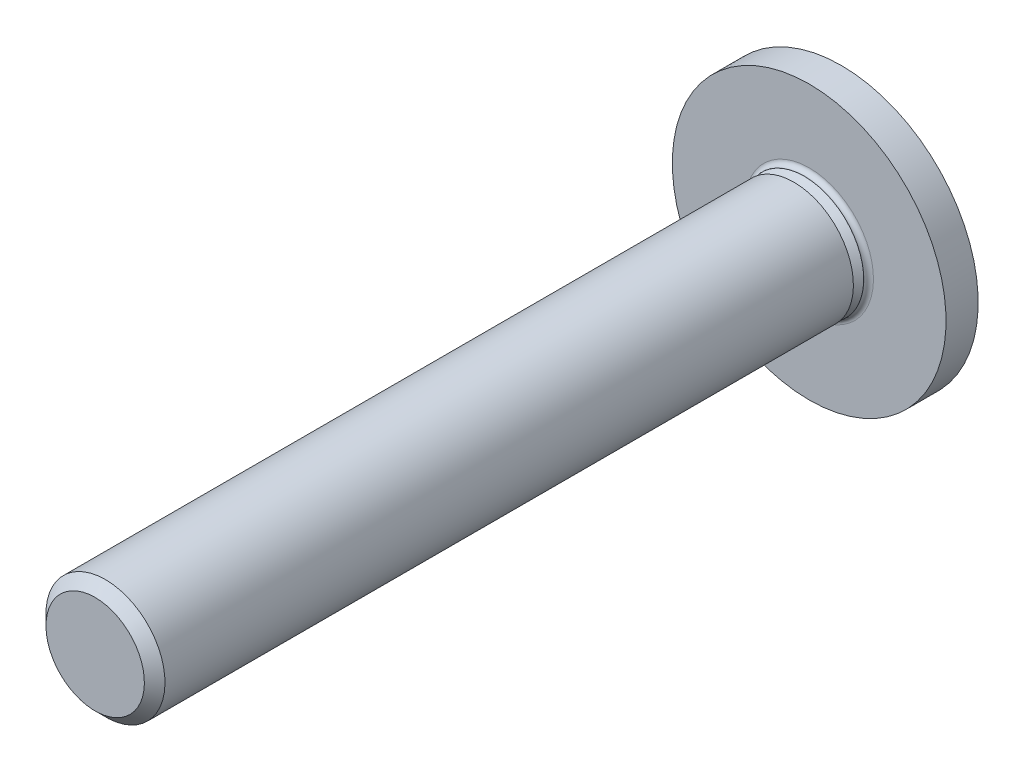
ISO-10303-21;
HEADER;
FILE_DESCRIPTION(('STEP AP214'),'2;1');
FILE_NAME('part.step','',(''),(''),'','','');
FILE_SCHEMA(('AUTOMOTIVE_DESIGN { 1 0 10303 214 1 1 1 1 }'));
ENDSEC;
DATA;
#1=APPLICATION_CONTEXT('core data for automotive mechanical design processes');
#2=APPLICATION_PROTOCOL_DEFINITION('international standard','automotive_design',2000,#1);
#3=PRODUCT_CONTEXT('',#1,'mechanical');
#4=PRODUCT('Part','Part','',(#3));
#5=PRODUCT_RELATED_PRODUCT_CATEGORY('part','',(#4));
#6=PRODUCT_DEFINITION_FORMATION('','',#4);
#7=PRODUCT_DEFINITION_CONTEXT('part definition',#1,'design');
#8=PRODUCT_DEFINITION('design','',#6,#7);
#9=PRODUCT_DEFINITION_SHAPE('','',#8);
#10=(LENGTH_UNIT() NAMED_UNIT(*) SI_UNIT(.MILLI.,.METRE.));
#11=(NAMED_UNIT(*) PLANE_ANGLE_UNIT() SI_UNIT($,.RADIAN.));
#12=(NAMED_UNIT(*) SI_UNIT($,.STERADIAN.) SOLID_ANGLE_UNIT());
#13=UNCERTAINTY_MEASURE_WITH_UNIT(LENGTH_MEASURE(1.E-05),#10,'distance_accuracy_value','');
#14=(GEOMETRIC_REPRESENTATION_CONTEXT(3) GLOBAL_UNCERTAINTY_ASSIGNED_CONTEXT((#13)) GLOBAL_UNIT_ASSIGNED_CONTEXT((#10,
#11,#12)) REPRESENTATION_CONTEXT('',''));
#15=CARTESIAN_POINT('',(0.,0.,0.));
#16=DIRECTION('',(0.,0.,1.));
#17=DIRECTION('',(1.,0.,0.));
#18=AXIS2_PLACEMENT_3D('',#15,#16,#17);
#19=CARTESIAN_POINT('',(0.,1.0335,33.55));
#20=DIRECTION('',(0.,0.,1.));
#21=DIRECTION('',(0.,1.,0.));
#22=AXIS2_PLACEMENT_3D('',#19,#20,#21);
#23=PLANE('',#22);
#24=CARTESIAN_POINT('',(0.,0.,33.55));
#25=DIRECTION('',(0.,0.,1.));
#26=DIRECTION('',(0.,1.,0.));
#27=AXIS2_PLACEMENT_3D('',#24,#25,#26);
#28=CIRCLE('',#27,2.067);
#29=CARTESIAN_POINT('',(0.,2.067,33.55));
#30=VERTEX_POINT('',#29);
#31=EDGE_CURVE('E11',#30,#30,#28,.T.);
#32=ORIENTED_EDGE('',*,*,#31,.T.);
#33=EDGE_LOOP('',(#32));
#34=FACE_BOUND('',#33,.T.);
#35=ADVANCED_FACE('F17',(#34),#23,.T.);
#36=CARTESIAN_POINT('',(0.,0.,33.3335));
#37=DIRECTION('',(0.,0.,-1.));
#38=DIRECTION('',(0.,1.,0.));
#39=AXIS2_PLACEMENT_3D('',#36,#37,#38);
#40=CONICAL_SURFACE('',#39,2.2835,0.785398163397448);
#41=CARTESIAN_POINT('',(0.,0.,33.117));
#42=DIRECTION('',(0.,0.,1.));
#43=DIRECTION('',(0.,1.,0.));
#44=AXIS2_PLACEMENT_3D('',#41,#42,#43);
#45=CIRCLE('',#44,2.5);
#46=CARTESIAN_POINT('',(0.,2.5,33.117));
#47=VERTEX_POINT('',#46);
#48=EDGE_CURVE('E27',#47,#47,#45,.T.);
#49=ORIENTED_EDGE('',*,*,#48,.T.);
#50=EDGE_LOOP('',(#49));
#51=FACE_BOUND('',#50,.T.);
#52=ORIENTED_EDGE('',*,*,#31,.F.);
#53=EDGE_LOOP('',(#52));
#54=FACE_BOUND('',#53,.T.);
#55=ADVANCED_FACE('F201',(#51,#54),#40,.T.);
#56=CARTESIAN_POINT('',(0.,0.,18.655));
#57=DIRECTION('',(0.,0.,-1.));
#58=DIRECTION('',(0.,1.,0.));
#59=AXIS2_PLACEMENT_3D('',#56,#57,#58);
#60=CYLINDRICAL_SURFACE('',#59,2.5);
#61=CARTESIAN_POINT('',(0.,0.,4.193));
#62=DIRECTION('',(0.,0.,1.));
#63=DIRECTION('',(0.,1.,0.));
#64=AXIS2_PLACEMENT_3D('',#61,#62,#63);
#65=CIRCLE('',#64,2.5);
#66=CARTESIAN_POINT('',(0.,2.5,4.193));
#67=VERTEX_POINT('',#66);
#68=EDGE_CURVE('E151',#67,#67,#65,.T.);
#69=ORIENTED_EDGE('',*,*,#68,.T.);
#70=EDGE_LOOP('',(#69));
#71=FACE_BOUND('',#70,.T.);
#72=ORIENTED_EDGE('',*,*,#48,.F.);
#73=EDGE_LOOP('',(#72));
#74=FACE_BOUND('',#73,.T.);
#75=ADVANCED_FACE('F19',(#71,#74),#60,.T.);
#76=CARTESIAN_POINT('',(0.,2.2835,4.193));
#77=DIRECTION('',(0.,0.,-1.));
#78=DIRECTION('',(0.,-1.,0.));
#79=AXIS2_PLACEMENT_3D('',#76,#77,#78);
#80=PLANE('',#79);
#81=CARTESIAN_POINT('',(0.,0.,4.193));
#82=DIRECTION('',(0.,0.,1.));
#83=DIRECTION('',(0.,1.,0.));
#84=AXIS2_PLACEMENT_3D('',#81,#82,#83);
#85=CIRCLE('',#84,2.067);
#86=CARTESIAN_POINT('',(0.,2.067,4.193));
#87=VERTEX_POINT('',#86);
#88=EDGE_CURVE('E21',#87,#87,#85,.T.);
#89=ORIENTED_EDGE('',*,*,#88,.T.);
#90=EDGE_LOOP('',(#89));
#91=FACE_BOUND('',#90,.T.);
#92=ORIENTED_EDGE('',*,*,#68,.F.);
#93=EDGE_LOOP('',(#92));
#94=FACE_BOUND('',#93,.T.);
#95=ADVANCED_FACE('F346',(#91,#94),#80,.T.);
#96=CARTESIAN_POINT('',(0.,0.,3.9765));
#97=DIRECTION('',(0.,0.,-1.));
#98=DIRECTION('',(0.,1.,0.));
#99=AXIS2_PLACEMENT_3D('',#96,#97,#98);
#100=CONICAL_SURFACE('',#99,2.2835,0.785398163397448);
#101=CARTESIAN_POINT('',(0.,0.,3.76));
#102=DIRECTION('',(0.,0.,1.));
#103=DIRECTION('',(0.,1.,0.));
#104=AXIS2_PLACEMENT_3D('',#101,#102,#103);
#105=CIRCLE('',#104,2.5);
#106=CARTESIAN_POINT('',(0.,2.5,3.76));
#107=VERTEX_POINT('',#106);
#108=EDGE_CURVE('E147',#107,#107,#105,.T.);
#109=ORIENTED_EDGE('',*,*,#108,.T.);
#110=EDGE_LOOP('',(#109));
#111=FACE_BOUND('',#110,.T.);
#112=ORIENTED_EDGE('',*,*,#88,.F.);
#113=EDGE_LOOP('',(#112));
#114=FACE_BOUND('',#113,.T.);
#115=ADVANCED_FACE('F196',(#111,#114),#100,.T.);
#116=CARTESIAN_POINT('',(0.,0.,3.755));
#117=DIRECTION('',(0.,0.,-1.));
#118=DIRECTION('',(0.,1.,0.));
#119=AXIS2_PLACEMENT_3D('',#116,#117,#118);
#120=CYLINDRICAL_SURFACE('',#119,2.5);
#121=CARTESIAN_POINT('',(0.,0.,3.75));
#122=DIRECTION('',(0.,0.,1.));
#123=DIRECTION('',(0.,1.,0.));
#124=AXIS2_PLACEMENT_3D('',#121,#122,#123);
#125=CIRCLE('',#124,2.5);
#126=CARTESIAN_POINT('',(0.,2.5,3.75));
#127=VERTEX_POINT('',#126);
#128=EDGE_CURVE('E149',#127,#127,#125,.T.);
#129=ORIENTED_EDGE('',*,*,#128,.T.);
#130=EDGE_LOOP('',(#129));
#131=FACE_BOUND('',#130,.T.);
#132=ORIENTED_EDGE('',*,*,#108,.F.);
#133=EDGE_LOOP('',(#132));
#134=FACE_BOUND('',#133,.T.);
#135=ADVANCED_FACE('F180',(#131,#134),#120,.T.);
#136=CARTESIAN_POINT('',(0.,0.,3.75));
#137=DIRECTION('',(0.,0.,1.));
#138=DIRECTION('',(1.,0.,0.));
#139=AXIS2_PLACEMENT_3D('',#136,#137,#138);
#140=TOROIDAL_SURFACE('',#139,2.7,0.2);
#141=CARTESIAN_POINT('',(0.,0.,3.55));
#142=DIRECTION('',(0.,0.,1.));
#143=DIRECTION('',(0.,1.,0.));
#144=AXIS2_PLACEMENT_3D('',#141,#142,#143);
#145=CIRCLE('',#144,2.7);
#146=CARTESIAN_POINT('',(0.,2.7,3.55));
#147=VERTEX_POINT('',#146);
#148=EDGE_CURVE('E170',#147,#147,#145,.T.);
#149=ORIENTED_EDGE('',*,*,#148,.T.);
#150=EDGE_LOOP('',(#149));
#151=FACE_BOUND('',#150,.T.);
#152=ORIENTED_EDGE('',*,*,#128,.F.);
#153=EDGE_LOOP('',(#152));
#154=FACE_BOUND('',#153,.T.);
#155=ADVANCED_FACE('F183',(#151,#154),#140,.F.);
#156=CARTESIAN_POINT('',(0.,4.225,3.55));
#157=DIRECTION('',(0.,0.,1.));
#158=DIRECTION('',(0.,1.,0.));
#159=AXIS2_PLACEMENT_3D('',#156,#157,#158);
#160=PLANE('',#159);
#161=CARTESIAN_POINT('',(0.,0.,3.55));
#162=DIRECTION('',(0.,0.,1.));
#163=DIRECTION('',(0.,1.,0.));
#164=AXIS2_PLACEMENT_3D('',#161,#162,#163);
#165=CIRCLE('',#164,5.75);
#166=CARTESIAN_POINT('',(0.,5.75,3.55));
#167=VERTEX_POINT('',#166);
#168=EDGE_CURVE('E172',#167,#167,#165,.T.);
#169=ORIENTED_EDGE('',*,*,#168,.T.);
#170=EDGE_LOOP('',(#169));
#171=FACE_BOUND('',#170,.T.);
#172=ORIENTED_EDGE('',*,*,#148,.F.);
#173=EDGE_LOOP('',(#172));
#174=FACE_BOUND('',#173,.T.);
#175=ADVANCED_FACE('F185',(#171,#174),#160,.T.);
#176=CARTESIAN_POINT('',(0.,0.,2.875));
#177=DIRECTION('',(0.,0.,-1.));
#178=DIRECTION('',(0.,1.,0.));
#179=AXIS2_PLACEMENT_3D('',#176,#177,#178);
#180=CYLINDRICAL_SURFACE('',#179,5.75);
#181=CARTESIAN_POINT('',(0.,0.,2.2));
#182=DIRECTION('',(0.,0.,1.));
#183=DIRECTION('',(0.,1.,0.));
#184=AXIS2_PLACEMENT_3D('',#181,#182,#183);
#185=CIRCLE('',#184,5.75);
#186=CARTESIAN_POINT('',(0.,5.75,2.2));
#187=VERTEX_POINT('',#186);
#188=EDGE_CURVE('E250',#187,#187,#185,.T.);
#189=ORIENTED_EDGE('',*,*,#188,.T.);
#190=EDGE_LOOP('',(#189));
#191=FACE_BOUND('',#190,.T.);
#192=ORIENTED_EDGE('',*,*,#168,.F.);
#193=EDGE_LOOP('',(#192));
#194=FACE_BOUND('',#193,.T.);
#195=ADVANCED_FACE('F193',(#191,#194),#180,.T.);
#196=CARTESIAN_POINT('',(0.,5.33467477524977,2.2));
#197=DIRECTION('',(0.,0.,-1.));
#198=DIRECTION('',(0.,-1.,0.));
#199=AXIS2_PLACEMENT_3D('',#196,#197,#198);
#200=PLANE('',#199);
#201=CARTESIAN_POINT('',(0.,0.,2.2));
#202=DIRECTION('',(0.,0.,1.));
#203=DIRECTION('',(0.,1.,0.));
#204=AXIS2_PLACEMENT_3D('',#201,#202,#203);
#205=CIRCLE('',#204,4.91934955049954);
#206=CARTESIAN_POINT('',(0.,4.91934955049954,2.2));
#207=VERTEX_POINT('',#206);
#208=EDGE_CURVE('E146',#207,#207,#205,.T.);
#209=ORIENTED_EDGE('',*,*,#208,.T.);
#210=EDGE_LOOP('',(#209));
#211=FACE_BOUND('',#210,.T.);
#212=ORIENTED_EDGE('',*,*,#188,.F.);
#213=EDGE_LOOP('',(#212));
#214=FACE_BOUND('',#213,.T.);
#215=ADVANCED_FACE('F233',(#211,#214),#200,.T.);
#216=CARTESIAN_POINT('',(0.,0.,6.6));
#217=DIRECTION('',(-1.,0.,0.));
#218=DIRECTION('',(0.,0.,1.));
#219=AXIS2_PLACEMENT_3D('',#216,#217,#218);
#220=SPHERICAL_SURFACE('',#219,6.6);
#221=ORIENTED_EDGE('',*,*,#208,.F.);
#222=EDGE_LOOP('',(#221));
#223=FACE_BOUND('',#222,.T.);
#224=CARTESIAN_POINT('',(0.282675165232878,0.131813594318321,6.51642730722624));
#225=DIRECTION('',(-0.875426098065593,-0.408217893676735,0.258819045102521));
#226=DIRECTION('',(-0.283517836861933,0.,-0.958966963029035));
#227=AXIS2_PLACEMENT_3D('',#224,#225,#226);
#228=CIRCLE('',#227,6.59209644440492);
#229=CARTESIAN_POINT('',(-1.04538251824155,-1.04538251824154,0.167710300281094));
#230=VERTEX_POINT('',#229);
#231=CARTESIAN_POINT('',(-0.339356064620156,-2.37864666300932,0.452896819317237));
#232=VERTEX_POINT('',#231);
#233=EDGE_CURVE('E123',#230,#232,#228,.T.);
#234=ORIENTED_EDGE('',*,*,#233,.T.);
#235=CARTESIAN_POINT('',(0.,-0.682531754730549,6.78288383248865));
#236=DIRECTION('',(0.,-0.965925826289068,0.258819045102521));
#237=DIRECTION('',(0.,0.258819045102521,0.965925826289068));
#238=AXIS2_PLACEMENT_3D('',#235,#236,#237);
#239=CIRCLE('',#238,6.56206552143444);
#240=CARTESIAN_POINT('',(0.339356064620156,-2.37864666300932,0.452896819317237));
#241=VERTEX_POINT('',#240);
#242=EDGE_CURVE('E141',#232,#241,#239,.T.);
#243=ORIENTED_EDGE('',*,*,#242,.T.);
#244=CARTESIAN_POINT('',(-0.282675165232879,0.131813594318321,6.51642730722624));
#245=DIRECTION('',(0.875426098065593,-0.408217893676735,0.258819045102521));
#246=DIRECTION('',(-0.283517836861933,0.,0.958966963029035));
#247=AXIS2_PLACEMENT_3D('',#244,#245,#246);
#248=CIRCLE('',#247,6.59209644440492);
#249=CARTESIAN_POINT('',(1.04538251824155,-1.04538251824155,0.167710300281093));
#250=VERTEX_POINT('',#249);
#251=EDGE_CURVE('E135',#241,#250,#248,.T.);
#252=ORIENTED_EDGE('',*,*,#251,.T.);
#253=CARTESIAN_POINT('',(-0.131813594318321,0.282675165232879,6.51642730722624));
#254=DIRECTION('',(0.408217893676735,-0.875426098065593,0.258819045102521));
#255=DIRECTION('',(0.,0.283517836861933,0.958966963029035));
#256=AXIS2_PLACEMENT_3D('',#253,#254,#255);
#257=CIRCLE('',#256,6.59209644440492);
#258=CARTESIAN_POINT('',(2.37864666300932,-0.339356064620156,0.452896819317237));
#259=VERTEX_POINT('',#258);
#260=EDGE_CURVE('E127',#250,#259,#257,.T.);
#261=ORIENTED_EDGE('',*,*,#260,.T.);
#262=CARTESIAN_POINT('',(0.682531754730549,0.,6.78288383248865));
#263=DIRECTION('',(0.965925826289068,0.,0.258819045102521));
#264=DIRECTION('',(-0.258819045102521,0.,0.965925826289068));
#265=AXIS2_PLACEMENT_3D('',#262,#263,#264);
#266=CIRCLE('',#265,6.56206552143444);
#267=CARTESIAN_POINT('',(2.37864666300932,0.339356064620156,0.452896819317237));
#268=VERTEX_POINT('',#267);
#269=EDGE_CURVE('E154',#259,#268,#266,.T.);
#270=ORIENTED_EDGE('',*,*,#269,.T.);
#271=CARTESIAN_POINT('',(-0.131813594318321,-0.282675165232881,6.51642730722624));
#272=DIRECTION('',(0.408217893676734,0.875426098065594,0.258819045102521));
#273=DIRECTION('',(0.,0.283517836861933,-0.958966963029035));
#274=AXIS2_PLACEMENT_3D('',#271,#272,#273);
#275=CIRCLE('',#274,6.59209644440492);
#276=CARTESIAN_POINT('',(1.04538251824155,1.04538251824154,0.167710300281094));
#277=VERTEX_POINT('',#276);
#278=EDGE_CURVE('E176',#268,#277,#275,.T.);
#279=ORIENTED_EDGE('',*,*,#278,.T.);
#280=CARTESIAN_POINT('',(-0.282675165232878,-0.131813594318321,6.51642730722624));
#281=DIRECTION('',(0.875426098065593,0.408217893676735,0.258819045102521));
#282=DIRECTION('',(-0.283517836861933,0.,0.958966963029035));
#283=AXIS2_PLACEMENT_3D('',#280,#281,#282);
#284=CIRCLE('',#283,6.59209644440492);
#285=CARTESIAN_POINT('',(0.339356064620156,2.37864666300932,0.452896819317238));
#286=VERTEX_POINT('',#285);
#287=EDGE_CURVE('E286',#277,#286,#284,.T.);
#288=ORIENTED_EDGE('',*,*,#287,.T.);
#289=CARTESIAN_POINT('',(0.,0.682531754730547,6.78288383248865));
#290=DIRECTION('',(0.,0.965925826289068,0.258819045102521));
#291=DIRECTION('',(0.,0.258819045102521,-0.965925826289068));
#292=AXIS2_PLACEMENT_3D('',#289,#290,#291);
#293=CIRCLE('',#292,6.56206552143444);
#294=CARTESIAN_POINT('',(-0.339356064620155,2.37864666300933,0.452896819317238));
#295=VERTEX_POINT('',#294);
#296=EDGE_CURVE('E269',#286,#295,#293,.T.);
#297=ORIENTED_EDGE('',*,*,#296,.T.);
#298=CARTESIAN_POINT('',(0.282675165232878,-0.13181359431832,6.51642730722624));
#299=DIRECTION('',(-0.875426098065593,0.408217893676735,0.258819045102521));
#300=DIRECTION('',(-0.283517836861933,0.,-0.958966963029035));
#301=AXIS2_PLACEMENT_3D('',#298,#299,#300);
#302=CIRCLE('',#301,6.59209644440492);
#303=CARTESIAN_POINT('',(-1.04538251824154,1.04538251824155,0.167710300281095));
#304=VERTEX_POINT('',#303);
#305=EDGE_CURVE('E113',#295,#304,#302,.T.);
#306=ORIENTED_EDGE('',*,*,#305,.T.);
#307=CARTESIAN_POINT('',(0.131813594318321,-0.282675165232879,6.51642730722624));
#308=DIRECTION('',(-0.408217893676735,0.875426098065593,0.258819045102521));
#309=DIRECTION('',(0.,0.283517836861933,-0.958966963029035));
#310=AXIS2_PLACEMENT_3D('',#307,#308,#309);
#311=CIRCLE('',#310,6.59209644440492);
#312=CARTESIAN_POINT('',(-2.37864666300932,0.339356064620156,0.452896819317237));
#313=VERTEX_POINT('',#312);
#314=EDGE_CURVE('E104',#304,#313,#311,.T.);
#315=ORIENTED_EDGE('',*,*,#314,.T.);
#316=CARTESIAN_POINT('',(-0.682531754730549,0.,6.78288383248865));
#317=DIRECTION('',(-0.965925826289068,0.,0.258819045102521));
#318=DIRECTION('',(-0.258819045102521,0.,-0.965925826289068));
#319=AXIS2_PLACEMENT_3D('',#316,#317,#318);
#320=CIRCLE('',#319,6.56206552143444);
#321=CARTESIAN_POINT('',(-2.37864666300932,-0.339356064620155,0.452896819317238));
#322=VERTEX_POINT('',#321);
#323=EDGE_CURVE('E87',#313,#322,#320,.T.);
#324=ORIENTED_EDGE('',*,*,#323,.T.);
#325=CARTESIAN_POINT('',(0.131813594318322,0.28267516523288,6.51642730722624));
#326=DIRECTION('',(-0.408217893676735,-0.875426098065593,0.258819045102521));
#327=DIRECTION('',(0.,0.283517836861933,0.958966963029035));
#328=AXIS2_PLACEMENT_3D('',#325,#326,#327);
#329=CIRCLE('',#328,6.59209644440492);
#330=EDGE_CURVE('E160',#322,#230,#329,.T.);
#331=ORIENTED_EDGE('',*,*,#330,.T.);
#332=EDGE_LOOP('',(#234,#243,#252,#261,#270,#279,#288,#297,#306,#315,#324,#331));
#333=FACE_BOUND('',#332,.T.);
#334=ADVANCED_FACE('F110',(#223,#333),#220,.T.);
#335=CARTESIAN_POINT('',(0.,0.,2.26));
#336=DIRECTION('',(0.,0.,1.));
#337=DIRECTION('',(1.,0.,0.));
#338=AXIS2_PLACEMENT_3D('',#335,#336,#337);
#339=PLANE('',#338);
#340=DIRECTION('',(-0.422618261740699,0.90630778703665,0.));
#341=VECTOR('',#340,1.);
#342=CARTESIAN_POINT('',(-0.530369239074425,-0.823274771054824,2.26));
#343=LINE('',#342,#341);
#344=CARTESIAN_POINT('',(-0.0308791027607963,-1.89443482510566,2.26));
#345=VERTEX_POINT('',#344);
#346=CARTESIAN_POINT('',(-0.623517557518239,-0.623517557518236,2.26));
#347=VERTEX_POINT('',#346);
#348=EDGE_CURVE('E125',#345,#347,#343,.T.);
#349=ORIENTED_EDGE('',*,*,#348,.T.);
#350=DIRECTION('',(-0.90630778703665,0.422618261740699,0.));
#351=VECTOR('',#350,1.);
#352=CARTESIAN_POINT('',(-2.24407709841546,0.132161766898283,2.26));
#353=LINE('',#352,#351);
#354=CARTESIAN_POINT('',(-1.89443482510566,-0.0308791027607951,2.26));
#355=VERTEX_POINT('',#354);
#356=EDGE_CURVE('E157',#347,#355,#353,.T.);
#357=ORIENTED_EDGE('',*,*,#356,.T.);
#358=DIRECTION('',(0.,1.,0.));
#359=VECTOR('',#358,1.);
#360=CARTESIAN_POINT('',(-1.89443482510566,0.416666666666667,2.26));
#361=LINE('',#360,#359);
#362=CARTESIAN_POINT('',(-1.89443482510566,0.0308791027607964,2.26));
#363=VERTEX_POINT('',#362);
#364=EDGE_CURVE('E98',#355,#363,#361,.T.);
#365=ORIENTED_EDGE('',*,*,#364,.T.);
#366=DIRECTION('',(0.90630778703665,0.422618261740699,0.));
#367=VECTOR('',#366,1.);
#368=CARTESIAN_POINT('',(-0.823274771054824,0.530369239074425,2.26));
#369=LINE('',#368,#367);
#370=CARTESIAN_POINT('',(-0.623517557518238,0.623517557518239,2.26));
#371=VERTEX_POINT('',#370);
#372=EDGE_CURVE('E106',#363,#371,#369,.T.);
#373=ORIENTED_EDGE('',*,*,#372,.T.);
#374=DIRECTION('',(0.422618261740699,0.90630778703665,0.));
#375=VECTOR('',#374,1.);
#376=CARTESIAN_POINT('',(0.132161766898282,2.24407709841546,2.26));
#377=LINE('',#376,#375);
#378=CARTESIAN_POINT('',(-0.0308791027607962,1.89443482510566,2.26));
#379=VERTEX_POINT('',#378);
#380=EDGE_CURVE('E117',#371,#379,#377,.T.);
#381=ORIENTED_EDGE('',*,*,#380,.T.);
#382=DIRECTION('',(1.,0.,0.));
#383=VECTOR('',#382,1.);
#384=CARTESIAN_POINT('',(0.416666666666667,1.89443482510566,2.26));
#385=LINE('',#384,#383);
#386=CARTESIAN_POINT('',(0.0308791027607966,1.89443482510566,2.26));
#387=VERTEX_POINT('',#386);
#388=EDGE_CURVE('E266',#379,#387,#385,.T.);
#389=ORIENTED_EDGE('',*,*,#388,.T.);
#390=DIRECTION('',(0.422618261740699,-0.90630778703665,0.));
#391=VECTOR('',#390,1.);
#392=CARTESIAN_POINT('',(0.530369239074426,0.823274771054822,2.26));
#393=LINE('',#392,#391);
#394=CARTESIAN_POINT('',(0.62351755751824,0.623517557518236,2.26));
#395=VERTEX_POINT('',#394);
#396=EDGE_CURVE('E277',#387,#395,#393,.T.);
#397=ORIENTED_EDGE('',*,*,#396,.T.);
#398=DIRECTION('',(0.90630778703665,-0.422618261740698,0.));
#399=VECTOR('',#398,1.);
#400=CARTESIAN_POINT('',(2.24407709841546,-0.132161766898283,2.26));
#401=LINE('',#400,#399);
#402=CARTESIAN_POINT('',(1.89443482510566,0.0308791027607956,2.26));
#403=VERTEX_POINT('',#402);
#404=EDGE_CURVE('E152',#395,#403,#401,.T.);
#405=ORIENTED_EDGE('',*,*,#404,.T.);
#406=DIRECTION('',(0.,-1.,0.));
#407=VECTOR('',#406,1.);
#408=CARTESIAN_POINT('',(1.89443482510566,-0.416666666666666,2.26));
#409=LINE('',#408,#407);
#410=CARTESIAN_POINT('',(1.89443482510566,-0.030879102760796,2.26));
#411=VERTEX_POINT('',#410);
#412=EDGE_CURVE('E131',#403,#411,#409,.T.);
#413=ORIENTED_EDGE('',*,*,#412,.T.);
#414=DIRECTION('',(-0.90630778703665,-0.422618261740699,0.));
#415=VECTOR('',#414,1.);
#416=CARTESIAN_POINT('',(0.823274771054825,-0.530369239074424,2.26));
#417=LINE('',#416,#415);
#418=CARTESIAN_POINT('',(0.623517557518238,-0.623517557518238,2.26));
#419=VERTEX_POINT('',#418);
#420=EDGE_CURVE('E132',#411,#419,#417,.T.);
#421=ORIENTED_EDGE('',*,*,#420,.T.);
#422=DIRECTION('',(-0.422618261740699,-0.90630778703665,0.));
#423=VECTOR('',#422,1.);
#424=CARTESIAN_POINT('',(-0.132161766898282,-2.24407709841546,2.26));
#425=LINE('',#424,#423);
#426=CARTESIAN_POINT('',(0.0308791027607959,-1.89443482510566,2.26));
#427=VERTEX_POINT('',#426);
#428=EDGE_CURVE('E139',#419,#427,#425,.T.);
#429=ORIENTED_EDGE('',*,*,#428,.T.);
#430=DIRECTION('',(-1.,0.,0.));
#431=VECTOR('',#430,1.);
#432=CARTESIAN_POINT('',(-0.416666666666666,-1.89443482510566,2.26));
#433=LINE('',#432,#431);
#434=EDGE_CURVE('E143',#427,#345,#433,.T.);
#435=ORIENTED_EDGE('',*,*,#434,.T.);
#436=EDGE_LOOP('',(#349,#357,#365,#373,#381,#389,#397,#405,#413,#421,#429,#435));
#437=FACE_BOUND('',#436,.T.);
#438=ADVANCED_FACE('F231',(#437),#339,.F.);
#439=CARTESIAN_POINT('',(0.416666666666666,-2.5,0.));
#440=DIRECTION('',(0.,-0.965925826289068,0.258819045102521));
#441=DIRECTION('',(1.,0.,0.));
#442=AXIS2_PLACEMENT_3D('',#439,#440,#441);
#443=PLANE('',#442);
#444=ORIENTED_EDGE('',*,*,#242,.F.);
#445=DIRECTION('',(0.162689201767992,0.255370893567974,0.953057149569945));
#446=VECTOR('',#445,1.);
#447=CARTESIAN_POINT('',(-0.405638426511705,-2.48268913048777,0.0646050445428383));
#448=LINE('',#447,#446);
#449=EDGE_CURVE('E163',#232,#345,#448,.T.);
#450=ORIENTED_EDGE('',*,*,#449,.T.);
#451=ORIENTED_EDGE('',*,*,#434,.F.);
#452=DIRECTION('',(-0.162689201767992,0.255370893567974,0.953057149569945));
#453=VECTOR('',#452,1.);
#454=CARTESIAN_POINT('',(0.395920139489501,-2.46743447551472,0.121536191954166));
#455=LINE('',#454,#453);
#456=EDGE_CURVE('E138',#241,#427,#455,.T.);
#457=ORIENTED_EDGE('',*,*,#456,.F.);
#458=EDGE_LOOP('',(#444,#450,#451,#457));
#459=FACE_BOUND('',#458,.T.);
#460=ADVANCED_FACE('F227',(#459),#443,.F.);
#461=CARTESIAN_POINT('',(1.07919767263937,-1.07919767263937,0.));
#462=DIRECTION('',(0.875426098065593,-0.408217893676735,0.258819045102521));
#463=DIRECTION('',(0.422618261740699,0.90630778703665,0.));
#464=AXIS2_PLACEMENT_3D('',#461,#462,#463);
#465=PLANE('',#464);
#466=ORIENTED_EDGE('',*,*,#251,.F.);
#467=ORIENTED_EDGE('',*,*,#456,.T.);
#468=ORIENTED_EDGE('',*,*,#428,.F.);
#469=DIRECTION('',(-0.193899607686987,0.193899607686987,0.961668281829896));
#470=VECTOR('',#469,1.);
#471=CARTESIAN_POINT('',(1.09345205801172,-1.09345205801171,-0.0706963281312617));
#472=LINE('',#471,#470);
#473=EDGE_CURVE('E130',#250,#419,#472,.T.);
#474=ORIENTED_EDGE('',*,*,#473,.F.);
#475=EDGE_LOOP('',(#466,#467,#468,#474));
#476=FACE_BOUND('',#475,.T.);
#477=ADVANCED_FACE('F230',(#476),#465,.F.);
#478=CARTESIAN_POINT('',(2.5,-0.416666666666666,0.));
#479=DIRECTION('',(0.408217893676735,-0.875426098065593,0.258819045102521));
#480=DIRECTION('',(0.90630778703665,0.422618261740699,0.));
#481=AXIS2_PLACEMENT_3D('',#478,#479,#480);
#482=PLANE('',#481);
#483=ORIENTED_EDGE('',*,*,#260,.F.);
#484=ORIENTED_EDGE('',*,*,#473,.T.);
#485=ORIENTED_EDGE('',*,*,#420,.F.);
#486=DIRECTION('',(-0.255370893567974,0.162689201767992,0.953057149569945));
#487=VECTOR('',#486,1.);
#488=CARTESIAN_POINT('',(2.48268913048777,-0.405638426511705,0.0646050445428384));
#489=LINE('',#488,#487);
#490=EDGE_CURVE('E167',#259,#411,#489,.T.);
#491=ORIENTED_EDGE('',*,*,#490,.F.);
#492=EDGE_LOOP('',(#483,#484,#485,#491));
#493=FACE_BOUND('',#492,.T.);
#494=ADVANCED_FACE('F214',(#493),#482,.F.);
#495=CARTESIAN_POINT('',(2.5,0.416666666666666,0.));
#496=DIRECTION('',(0.965925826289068,0.,0.258819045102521));
#497=DIRECTION('',(0.,1.,0.));
#498=AXIS2_PLACEMENT_3D('',#495,#496,#497);
#499=PLANE('',#498);
#500=ORIENTED_EDGE('',*,*,#269,.F.);
#501=ORIENTED_EDGE('',*,*,#490,.T.);
#502=ORIENTED_EDGE('',*,*,#412,.F.);
#503=DIRECTION('',(-0.255370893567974,-0.162689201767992,0.953057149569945));
#504=VECTOR('',#503,1.);
#505=CARTESIAN_POINT('',(2.46743447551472,0.395920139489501,0.121536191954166));
#506=LINE('',#505,#504);
#507=EDGE_CURVE('E155',#268,#403,#506,.T.);
#508=ORIENTED_EDGE('',*,*,#507,.F.);
#509=EDGE_LOOP('',(#500,#501,#502,#508));
#510=FACE_BOUND('',#509,.T.);
#511=ADVANCED_FACE('F210',(#510),#499,.F.);
#512=CARTESIAN_POINT('',(1.07919767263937,1.07919767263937,0.));
#513=DIRECTION('',(0.408217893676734,0.875426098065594,0.258819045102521));
#514=DIRECTION('',(-0.90630778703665,0.422618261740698,0.));
#515=AXIS2_PLACEMENT_3D('',#512,#513,#514);
#516=PLANE('',#515);
#517=ORIENTED_EDGE('',*,*,#278,.F.);
#518=ORIENTED_EDGE('',*,*,#507,.T.);
#519=ORIENTED_EDGE('',*,*,#404,.F.);
#520=DIRECTION('',(-0.193899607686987,-0.193899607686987,0.961668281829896));
#521=VECTOR('',#520,1.);
#522=CARTESIAN_POINT('',(1.09345205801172,1.09345205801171,-0.0706963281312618));
#523=LINE('',#522,#521);
#524=EDGE_CURVE('E121',#277,#395,#523,.T.);
#525=ORIENTED_EDGE('',*,*,#524,.F.);
#526=EDGE_LOOP('',(#517,#518,#519,#525));
#527=FACE_BOUND('',#526,.T.);
#528=ADVANCED_FACE('F213',(#527),#516,.F.);
#529=CARTESIAN_POINT('',(-0.416666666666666,-2.5,0.));
#530=DIRECTION('',(-0.875426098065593,-0.408217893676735,0.258819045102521));
#531=DIRECTION('',(0.422618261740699,-0.90630778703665,0.));
#532=AXIS2_PLACEMENT_3D('',#529,#530,#531);
#533=PLANE('',#532);
#534=ORIENTED_EDGE('',*,*,#233,.F.);
#535=DIRECTION('',(0.193899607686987,0.193899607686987,0.961668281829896));
#536=VECTOR('',#535,1.);
#537=CARTESIAN_POINT('',(-1.09345205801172,-1.09345205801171,-0.0706963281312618));
#538=LINE('',#537,#536);
#539=EDGE_CURVE('E126',#230,#347,#538,.T.);
#540=ORIENTED_EDGE('',*,*,#539,.T.);
#541=ORIENTED_EDGE('',*,*,#348,.F.);
#542=ORIENTED_EDGE('',*,*,#449,.F.);
#543=EDGE_LOOP('',(#534,#540,#541,#542));
#544=FACE_BOUND('',#543,.T.);
#545=ADVANCED_FACE('F218',(#544),#533,.F.);
#546=CARTESIAN_POINT('',(-1.07919767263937,-1.07919767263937,0.));
#547=DIRECTION('',(-0.408217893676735,-0.875426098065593,0.258819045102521));
#548=DIRECTION('',(0.90630778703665,-0.422618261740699,0.));
#549=AXIS2_PLACEMENT_3D('',#546,#547,#548);
#550=PLANE('',#549);
#551=ORIENTED_EDGE('',*,*,#330,.F.);
#552=DIRECTION('',(0.255370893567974,0.162689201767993,0.953057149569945));
#553=VECTOR('',#552,1.);
#554=CARTESIAN_POINT('',(-2.46743447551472,-0.3959201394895,0.121536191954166));
#555=LINE('',#554,#553);
#556=EDGE_CURVE('E94',#322,#355,#555,.T.);
#557=ORIENTED_EDGE('',*,*,#556,.T.);
#558=ORIENTED_EDGE('',*,*,#356,.F.);
#559=ORIENTED_EDGE('',*,*,#539,.F.);
#560=EDGE_LOOP('',(#551,#557,#558,#559));
#561=FACE_BOUND('',#560,.T.);
#562=ADVANCED_FACE('F222',(#561),#550,.F.);
#563=CARTESIAN_POINT('',(-2.5,-0.416666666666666,0.));
#564=DIRECTION('',(-0.965925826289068,0.,0.258819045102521));
#565=DIRECTION('',(0.,-1.,0.));
#566=AXIS2_PLACEMENT_3D('',#563,#564,#565);
#567=PLANE('',#566);
#568=ORIENTED_EDGE('',*,*,#323,.F.);
#569=DIRECTION('',(0.255370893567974,-0.162689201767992,0.953057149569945));
#570=VECTOR('',#569,1.);
#571=CARTESIAN_POINT('',(-2.48268913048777,0.405638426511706,0.0646050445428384));
#572=LINE('',#571,#570);
#573=EDGE_CURVE('E91',#313,#363,#572,.T.);
#574=ORIENTED_EDGE('',*,*,#573,.T.);
#575=ORIENTED_EDGE('',*,*,#364,.F.);
#576=ORIENTED_EDGE('',*,*,#556,.F.);
#577=EDGE_LOOP('',(#568,#574,#575,#576));
#578=FACE_BOUND('',#577,.T.);
#579=ADVANCED_FACE('F89',(#578),#567,.F.);
#580=CARTESIAN_POINT('',(-2.5,0.416666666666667,0.));
#581=DIRECTION('',(-0.408217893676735,0.875426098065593,0.258819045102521));
#582=DIRECTION('',(-0.90630778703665,-0.422618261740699,0.));
#583=AXIS2_PLACEMENT_3D('',#580,#581,#582);
#584=PLANE('',#583);
#585=ORIENTED_EDGE('',*,*,#314,.F.);
#586=DIRECTION('',(0.193899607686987,-0.193899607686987,0.961668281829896));
#587=VECTOR('',#586,1.);
#588=CARTESIAN_POINT('',(-1.09345205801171,1.09345205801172,-0.0706963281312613));
#589=LINE('',#588,#587);
#590=EDGE_CURVE('E114',#304,#371,#589,.T.);
#591=ORIENTED_EDGE('',*,*,#590,.T.);
#592=ORIENTED_EDGE('',*,*,#372,.F.);
#593=ORIENTED_EDGE('',*,*,#573,.F.);
#594=EDGE_LOOP('',(#585,#591,#592,#593));
#595=FACE_BOUND('',#594,.T.);
#596=ADVANCED_FACE('F102',(#595),#584,.F.);
#597=CARTESIAN_POINT('',(-1.07919767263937,1.07919767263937,0.));
#598=DIRECTION('',(-0.875426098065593,0.408217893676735,0.258819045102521));
#599=DIRECTION('',(-0.422618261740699,-0.90630778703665,0.));
#600=AXIS2_PLACEMENT_3D('',#597,#598,#599);
#601=PLANE('',#600);
#602=ORIENTED_EDGE('',*,*,#305,.F.);
#603=DIRECTION('',(0.162689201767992,-0.255370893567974,0.953057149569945));
#604=VECTOR('',#603,1.);
#605=CARTESIAN_POINT('',(-0.3959201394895,2.46743447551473,0.121536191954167));
#606=LINE('',#605,#604);
#607=EDGE_CURVE('E268',#295,#379,#606,.T.);
#608=ORIENTED_EDGE('',*,*,#607,.T.);
#609=ORIENTED_EDGE('',*,*,#380,.F.);
#610=ORIENTED_EDGE('',*,*,#590,.F.);
#611=EDGE_LOOP('',(#602,#608,#609,#610));
#612=FACE_BOUND('',#611,.T.);
#613=ADVANCED_FACE('F240',(#612),#601,.F.);
#614=CARTESIAN_POINT('',(-0.416666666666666,2.5,0.));
#615=DIRECTION('',(0.,0.965925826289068,0.258819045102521));
#616=DIRECTION('',(-1.,0.,0.));
#617=AXIS2_PLACEMENT_3D('',#614,#615,#616);
#618=PLANE('',#617);
#619=ORIENTED_EDGE('',*,*,#296,.F.);
#620=DIRECTION('',(-0.162689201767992,-0.255370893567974,0.953057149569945));
#621=VECTOR('',#620,1.);
#622=CARTESIAN_POINT('',(0.405638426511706,2.48268913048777,0.0646050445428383));
#623=LINE('',#622,#621);
#624=EDGE_CURVE('E275',#286,#387,#623,.T.);
#625=ORIENTED_EDGE('',*,*,#624,.T.);
#626=ORIENTED_EDGE('',*,*,#388,.F.);
#627=ORIENTED_EDGE('',*,*,#607,.F.);
#628=EDGE_LOOP('',(#619,#625,#626,#627));
#629=FACE_BOUND('',#628,.T.);
#630=ADVANCED_FACE('F237',(#629),#618,.F.);
#631=CARTESIAN_POINT('',(0.416666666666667,2.5,0.));
#632=DIRECTION('',(0.875426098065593,0.408217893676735,0.258819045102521));
#633=DIRECTION('',(-0.422618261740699,0.90630778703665,0.));
#634=AXIS2_PLACEMENT_3D('',#631,#632,#633);
#635=PLANE('',#634);
#636=ORIENTED_EDGE('',*,*,#287,.F.);
#637=ORIENTED_EDGE('',*,*,#524,.T.);
#638=ORIENTED_EDGE('',*,*,#396,.F.);
#639=ORIENTED_EDGE('',*,*,#624,.F.);
#640=EDGE_LOOP('',(#636,#637,#638,#639));
#641=FACE_BOUND('',#640,.T.);
#642=ADVANCED_FACE('F239',(#641),#635,.F.);
#643=CLOSED_SHELL('',(#35,#55,#75,#95,#115,#135,#155,#175,#195,#215,#334,#438,#460,#477,#494,
#511,#528,#545,#562,#579,#596,#613,#630,#642));
#644=MANIFOLD_SOLID_BREP('B1',#643);
#645=ADVANCED_BREP_SHAPE_REPRESENTATION('',(#18,#644),#14);
#646=SHAPE_DEFINITION_REPRESENTATION(#9,#645);
ENDSEC;
END-ISO-10303-21;
